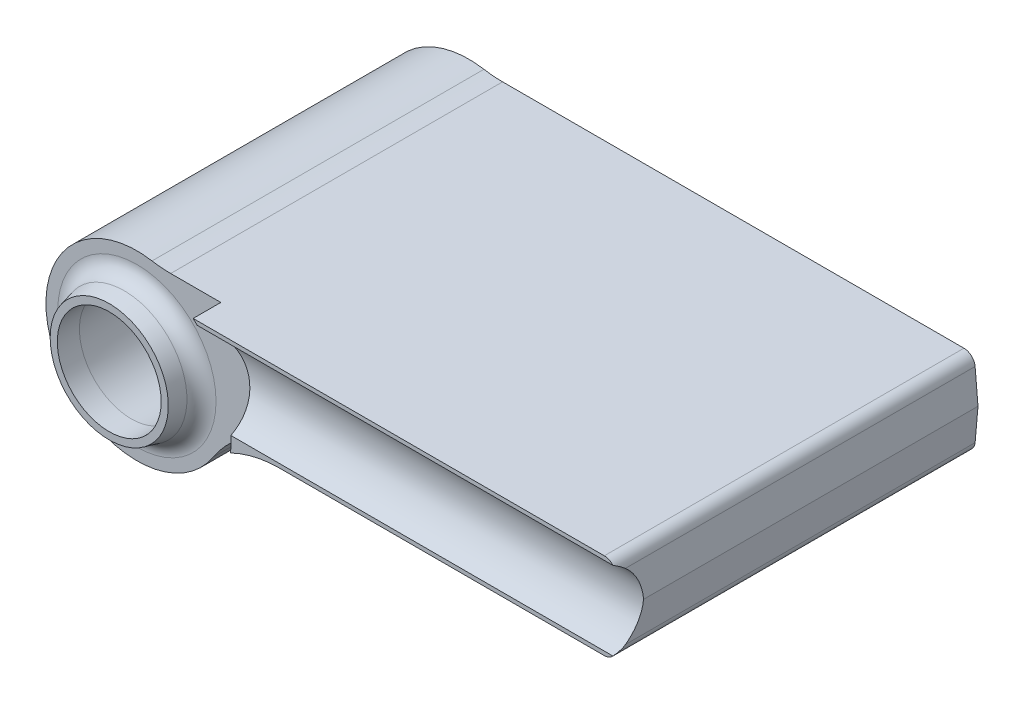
ISO-10303-21;
HEADER;
FILE_DESCRIPTION(('STEP AP214'),'2;1');
FILE_NAME('part.step','',(''),(''),'','','');
FILE_SCHEMA(('AUTOMOTIVE_DESIGN { 1 0 10303 214 1 1 1 1 }'));
ENDSEC;
DATA;
#1=APPLICATION_CONTEXT('core data for automotive mechanical design processes');
#2=APPLICATION_PROTOCOL_DEFINITION('international standard','automotive_design',2000,#1);
#3=PRODUCT_CONTEXT('',#1,'mechanical');
#4=PRODUCT('Part','Part','',(#3));
#5=PRODUCT_RELATED_PRODUCT_CATEGORY('part','',(#4));
#6=PRODUCT_DEFINITION_FORMATION('','',#4);
#7=PRODUCT_DEFINITION_CONTEXT('part definition',#1,'design');
#8=PRODUCT_DEFINITION('design','',#6,#7);
#9=PRODUCT_DEFINITION_SHAPE('','',#8);
#10=(LENGTH_UNIT() NAMED_UNIT(*) SI_UNIT(.MILLI.,.METRE.));
#11=(NAMED_UNIT(*) PLANE_ANGLE_UNIT() SI_UNIT($,.RADIAN.));
#12=(NAMED_UNIT(*) SI_UNIT($,.STERADIAN.) SOLID_ANGLE_UNIT());
#13=UNCERTAINTY_MEASURE_WITH_UNIT(LENGTH_MEASURE(1.E-05),#10,'distance_accuracy_value','');
#14=(GEOMETRIC_REPRESENTATION_CONTEXT(3) GLOBAL_UNCERTAINTY_ASSIGNED_CONTEXT((#13)) GLOBAL_UNIT_ASSIGNED_CONTEXT((#10,
#11,#12)) REPRESENTATION_CONTEXT('',''));
#15=CARTESIAN_POINT('',(0.,0.,0.));
#16=DIRECTION('',(0.,0.,1.));
#17=DIRECTION('',(1.,0.,0.));
#18=AXIS2_PLACEMENT_3D('',#15,#16,#17);
#19=CARTESIAN_POINT('',(30.8284770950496,-19.995,65.));
#20=DIRECTION('',(0.,0.,1.));
#21=DIRECTION('',(1.,0.,0.));
#22=AXIS2_PLACEMENT_3D('',#19,#20,#21);
#23=PLANE('',#22);
#24=DIRECTION('',(1.,0.,0.));
#25=VECTOR('',#24,1.);
#26=CARTESIAN_POINT('',(-16.446,1.0220196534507,65.));
#27=LINE('',#26,#25);
#28=CARTESIAN_POINT('',(91.0380668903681,1.0220196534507,65.));
#29=VERTEX_POINT('',#28);
#30=CARTESIAN_POINT('',(21.9762479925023,1.0220196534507,65.));
#31=VERTEX_POINT('',#30);
#32=EDGE_CURVE('E158',#29,#31,#27,.F.);
#33=ORIENTED_EDGE('',*,*,#32,.T.);
#34=CARTESIAN_POINT('',(0.,0.,65.));
#35=DIRECTION('',(0.,0.,-1.));
#36=DIRECTION('',(-1.,0.,0.));
#37=AXIS2_PLACEMENT_3D('',#34,#35,#36);
#38=CIRCLE('',#37,22.);
#39=CARTESIAN_POINT('',(21.9303605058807,-1.74908206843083,65.));
#40=VERTEX_POINT('',#39);
#41=EDGE_CURVE('E53',#31,#40,#38,.T.);
#42=ORIENTED_EDGE('',*,*,#41,.T.);
#43=CARTESIAN_POINT('',(30.8284770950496,-19.995,65.));
#44=DIRECTION('',(0.,0.,-1.));
#45=DIRECTION('',(1.,0.,0.));
#46=AXIS2_PLACEMENT_3D('',#43,#44,#45);
#47=CIRCLE('',#46,20.3);
#48=CARTESIAN_POINT('',(30.8284770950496,0.305,65.));
#49=VERTEX_POINT('',#48);
#50=EDGE_CURVE('E242',#40,#49,#47,.T.);
#51=ORIENTED_EDGE('',*,*,#50,.T.);
#52=DIRECTION('',(1.,0.,0.));
#53=VECTOR('',#52,1.);
#54=CARTESIAN_POINT('',(30.8284770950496,0.305,65.));
#55=LINE('',#54,#53);
#56=CARTESIAN_POINT('',(89.4898477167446,0.305,65.));
#57=VERTEX_POINT('',#56);
#58=EDGE_CURVE('E244',#49,#57,#55,.T.);
#59=ORIENTED_EDGE('',*,*,#58,.T.);
#60=CARTESIAN_POINT('',(89.4898477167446,2.335,65.));
#61=DIRECTION('',(0.,0.,1.));
#62=DIRECTION('',(1.,0.,0.));
#63=AXIS2_PLACEMENT_3D('',#60,#61,#62);
#64=CIRCLE('',#63,2.03);
#65=EDGE_CURVE('E246',#57,#29,#64,.T.);
#66=ORIENTED_EDGE('',*,*,#65,.T.);
#67=EDGE_LOOP('',(#33,#42,#51,#59,#66));
#68=FACE_BOUND('',#67,.T.);
#69=ADVANCED_FACE('F30',(#68),#23,.T.);
#70=CARTESIAN_POINT('',(30.8284770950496,-19.995,65.));
#71=DIRECTION('',(0.,0.,-1.));
#72=DIRECTION('',(-1.,0.,0.));
#73=AXIS2_PLACEMENT_3D('',#70,#71,#72);
#74=CYLINDRICAL_SURFACE('',#73,20.3);
#75=DIRECTION('',(0.,0.,-1.));
#76=VECTOR('',#75,1.);
#77=CARTESIAN_POINT('',(21.9303605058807,-1.74908206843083,62.5));
#78=LINE('',#77,#76);
#79=CARTESIAN_POINT('',(21.9303605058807,-1.74908206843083,60.));
#80=VERTEX_POINT('',#79);
#81=EDGE_CURVE('E209',#80,#40,#78,.F.);
#82=ORIENTED_EDGE('',*,*,#81,.F.);
#83=CARTESIAN_POINT('',(30.8284770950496,-19.995,60.));
#84=DIRECTION('',(0.,0.,1.));
#85=DIRECTION('',(1.,0.,0.));
#86=AXIS2_PLACEMENT_3D('',#83,#84,#85);
#87=CIRCLE('',#86,20.3);
#88=CARTESIAN_POINT('',(13.7970963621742,-8.94863995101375,60.));
#89=VERTEX_POINT('',#88);
#90=EDGE_CURVE('E215',#89,#80,#87,.F.);
#91=ORIENTED_EDGE('',*,*,#90,.F.);
#92=DIRECTION('',(0.,0.,-1.));
#93=VECTOR('',#92,1.);
#94=CARTESIAN_POINT('',(13.7970963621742,-8.94863995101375,65.));
#95=LINE('',#94,#93);
#96=CARTESIAN_POINT('',(13.7970963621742,-8.94863995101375,0.));
#97=VERTEX_POINT('',#96);
#98=EDGE_CURVE('E254',#89,#97,#95,.T.);
#99=ORIENTED_EDGE('',*,*,#98,.T.);
#100=CARTESIAN_POINT('',(30.8284770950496,-19.995,0.));
#101=DIRECTION('',(0.,0.,-1.));
#102=DIRECTION('',(1.,0.,0.));
#103=AXIS2_PLACEMENT_3D('',#100,#101,#102);
#104=CIRCLE('',#103,20.3);
#105=CARTESIAN_POINT('',(30.8284770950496,0.305,0.));
#106=VERTEX_POINT('',#105);
#107=EDGE_CURVE('E217',#97,#106,#104,.T.);
#108=ORIENTED_EDGE('',*,*,#107,.T.);
#109=DIRECTION('',(0.,0.,-1.));
#110=VECTOR('',#109,1.);
#111=CARTESIAN_POINT('',(30.8284770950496,0.305,65.));
#112=LINE('',#111,#110);
#113=EDGE_CURVE('E38',#49,#106,#112,.T.);
#114=ORIENTED_EDGE('',*,*,#113,.F.);
#115=ORIENTED_EDGE('',*,*,#50,.F.);
#116=EDGE_LOOP('',(#82,#91,#99,#108,#114,#115));
#117=FACE_BOUND('',#116,.T.);
#118=ADVANCED_FACE('F32',(#117),#74,.F.);
#119=CARTESIAN_POINT('',(6.10080322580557,15.935,65.));
#120=DIRECTION('',(0.,-1.,0.));
#121=DIRECTION('',(0.,0.,-1.));
#122=AXIS2_PLACEMENT_3D('',#119,#120,#121);
#123=PLANE('',#122);
#124=DIRECTION('',(0.,0.,-1.));
#125=VECTOR('',#124,1.);
#126=CARTESIAN_POINT('',(15.1682489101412,15.935,-7.82372390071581));
#127=LINE('',#126,#125);
#128=CARTESIAN_POINT('',(15.1682489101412,15.935,65.));
#129=VERTEX_POINT('',#128);
#130=CARTESIAN_POINT('',(15.1682489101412,15.935,60.));
#131=VERTEX_POINT('',#130);
#132=EDGE_CURVE('E207',#129,#131,#127,.T.);
#133=ORIENTED_EDGE('',*,*,#132,.F.);
#134=DIRECTION('',(-1.,0.,0.));
#135=VECTOR('',#134,1.);
#136=CARTESIAN_POINT('',(6.10080322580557,15.935,65.));
#137=LINE('',#136,#135);
#138=CARTESIAN_POINT('',(89.4898477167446,15.935,65.));
#139=VERTEX_POINT('',#138);
#140=EDGE_CURVE('E251',#139,#129,#137,.T.);
#141=ORIENTED_EDGE('',*,*,#140,.F.);
#142=DIRECTION('',(0.,0.,-1.));
#143=VECTOR('',#142,1.);
#144=CARTESIAN_POINT('',(89.4898477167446,15.935,65.));
#145=LINE('',#144,#143);
#146=CARTESIAN_POINT('',(89.4898477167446,15.935,0.));
#147=VERTEX_POINT('',#146);
#148=EDGE_CURVE('E260',#139,#147,#145,.T.);
#149=ORIENTED_EDGE('',*,*,#148,.T.);
#150=DIRECTION('',(-1.,0.,0.));
#151=VECTOR('',#150,1.);
#152=CARTESIAN_POINT('',(6.10080322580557,15.935,0.));
#153=LINE('',#152,#151);
#154=CARTESIAN_POINT('',(6.10080322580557,15.935,0.));
#155=VERTEX_POINT('',#154);
#156=EDGE_CURVE('E233',#147,#155,#153,.T.);
#157=ORIENTED_EDGE('',*,*,#156,.T.);
#158=DIRECTION('',(0.,0.,-1.));
#159=VECTOR('',#158,1.);
#160=CARTESIAN_POINT('',(6.10080322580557,15.935,65.));
#161=LINE('',#160,#159);
#162=CARTESIAN_POINT('',(6.10080322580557,15.935,60.));
#163=VERTEX_POINT('',#162);
#164=EDGE_CURVE('E258',#163,#155,#161,.T.);
#165=ORIENTED_EDGE('',*,*,#164,.F.);
#166=DIRECTION('',(-1.,0.,0.));
#167=VECTOR('',#166,1.);
#168=CARTESIAN_POINT('',(6.10080322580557,15.935,60.));
#169=LINE('',#168,#167);
#170=EDGE_CURVE('E213',#131,#163,#169,.T.);
#171=ORIENTED_EDGE('',*,*,#170,.F.);
#172=EDGE_LOOP('',(#133,#141,#149,#157,#165,#171));
#173=FACE_BOUND('',#172,.T.);
#174=ADVANCED_FACE('F305',(#173),#123,.F.);
#175=CARTESIAN_POINT('',(6.10080322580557,36.235,65.));
#176=DIRECTION('',(0.,0.,-1.));
#177=DIRECTION('',(-1.,0.,0.));
#178=AXIS2_PLACEMENT_3D('',#175,#176,#177);
#179=CYLINDRICAL_SURFACE('',#178,20.3);
#180=CARTESIAN_POINT('',(6.10080322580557,36.235,60.));
#181=DIRECTION('',(0.,0.,1.));
#182=DIRECTION('',(1.,0.,0.));
#183=AXIS2_PLACEMENT_3D('',#180,#181,#182);
#184=CIRCLE('',#183,20.3);
#185=CARTESIAN_POINT('',(2.73037716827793,16.216752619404,60.));
#186=VERTEX_POINT('',#185);
#187=EDGE_CURVE('E211',#163,#186,#184,.F.);
#188=ORIENTED_EDGE('',*,*,#187,.F.);
#189=ORIENTED_EDGE('',*,*,#164,.T.);
#190=CARTESIAN_POINT('',(6.10080322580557,36.235,0.));
#191=DIRECTION('',(0.,0.,-1.));
#192=DIRECTION('',(1.,0.,0.));
#193=AXIS2_PLACEMENT_3D('',#190,#191,#192);
#194=CIRCLE('',#193,20.3);
#195=CARTESIAN_POINT('',(2.73037716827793,16.216752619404,0.));
#196=VERTEX_POINT('',#195);
#197=EDGE_CURVE('E236',#155,#196,#194,.T.);
#198=ORIENTED_EDGE('',*,*,#197,.T.);
#199=DIRECTION('',(0.,0.,-1.));
#200=VECTOR('',#199,1.);
#201=CARTESIAN_POINT('',(2.73037716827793,16.216752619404,65.));
#202=LINE('',#201,#200);
#203=EDGE_CURVE('E256',#186,#196,#202,.T.);
#204=ORIENTED_EDGE('',*,*,#203,.F.);
#205=EDGE_LOOP('',(#188,#189,#198,#204));
#206=FACE_BOUND('',#205,.T.);
#207=ADVANCED_FACE('F309',(#206),#179,.F.);
#208=CARTESIAN_POINT('',(0.,0.,65.));
#209=DIRECTION('',(0.,0.,-1.));
#210=DIRECTION('',(-1.,0.,0.));
#211=AXIS2_PLACEMENT_3D('',#208,#209,#210);
#212=CYLINDRICAL_SURFACE('',#211,16.445);
#213=CARTESIAN_POINT('',(0.,0.,60.));
#214=DIRECTION('',(0.,0.,1.));
#215=DIRECTION('',(1.,0.,0.));
#216=AXIS2_PLACEMENT_3D('',#213,#214,#215);
#217=CIRCLE('',#216,16.445);
#218=EDGE_CURVE('E11',#186,#89,#217,.T.);
#219=ORIENTED_EDGE('',*,*,#218,.F.);
#220=ORIENTED_EDGE('',*,*,#203,.T.);
#221=CARTESIAN_POINT('',(0.,0.,0.));
#222=DIRECTION('',(0.,0.,1.));
#223=DIRECTION('',(1.,0.,0.));
#224=AXIS2_PLACEMENT_3D('',#221,#222,#223);
#225=CIRCLE('',#224,16.445);
#226=EDGE_CURVE('E239',#196,#97,#225,.T.);
#227=ORIENTED_EDGE('',*,*,#226,.T.);
#228=ORIENTED_EDGE('',*,*,#98,.F.);
#229=EDGE_LOOP('',(#219,#220,#227,#228));
#230=FACE_BOUND('',#229,.T.);
#231=ADVANCED_FACE('F313',(#230),#212,.T.);
#232=DIRECTION('',(1.,0.,0.));
#233=VECTOR('',#232,1.);
#234=CARTESIAN_POINT('',(-16.446,15.2179803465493,65.));
#235=LINE('',#234,#233);
#236=CARTESIAN_POINT('',(15.8875131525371,15.2179803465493,65.));
#237=VERTEX_POINT('',#236);
#238=CARTESIAN_POINT('',(91.0380668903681,15.2179803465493,65.));
#239=VERTEX_POINT('',#238);
#240=EDGE_CURVE('E45',#237,#239,#235,.T.);
#241=ORIENTED_EDGE('',*,*,#240,.T.);
#242=CARTESIAN_POINT('',(89.4898477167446,13.905,65.));
#243=DIRECTION('',(0.,0.,1.));
#244=DIRECTION('',(-1.,0.,0.));
#245=AXIS2_PLACEMENT_3D('',#242,#243,#244);
#246=CIRCLE('',#245,2.03);
#247=EDGE_CURVE('E249',#239,#139,#246,.T.);
#248=ORIENTED_EDGE('',*,*,#247,.T.);
#249=ORIENTED_EDGE('',*,*,#140,.T.);
#250=EDGE_CURVE('E204',#129,#237,#38,.T.);
#251=ORIENTED_EDGE('',*,*,#250,.T.);
#252=EDGE_LOOP('',(#241,#248,#249,#251));
#253=FACE_BOUND('',#252,.T.);
#254=ADVANCED_FACE('F315',(#253),#23,.T.);
#255=CARTESIAN_POINT('',(30.8284770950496,0.305,65.));
#256=DIRECTION('',(0.,1.,0.));
#257=DIRECTION('',(0.,0.,1.));
#258=AXIS2_PLACEMENT_3D('',#255,#256,#257);
#259=PLANE('',#258);
#260=DIRECTION('',(1.,0.,0.));
#261=VECTOR('',#260,1.);
#262=CARTESIAN_POINT('',(30.8284770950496,0.305,0.));
#263=LINE('',#262,#261);
#264=CARTESIAN_POINT('',(89.4898477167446,0.305,0.));
#265=VERTEX_POINT('',#264);
#266=EDGE_CURVE('E220',#106,#265,#263,.T.);
#267=ORIENTED_EDGE('',*,*,#266,.T.);
#268=DIRECTION('',(0.,0.,-1.));
#269=VECTOR('',#268,1.);
#270=CARTESIAN_POINT('',(89.4898477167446,0.305,65.));
#271=LINE('',#270,#269);
#272=EDGE_CURVE('E269',#57,#265,#271,.T.);
#273=ORIENTED_EDGE('',*,*,#272,.F.);
#274=ORIENTED_EDGE('',*,*,#58,.F.);
#275=ORIENTED_EDGE('',*,*,#113,.T.);
#276=EDGE_LOOP('',(#267,#273,#274,#275));
#277=FACE_BOUND('',#276,.T.);
#278=ADVANCED_FACE('F275',(#277),#259,.F.);
#279=CARTESIAN_POINT('',(89.4898477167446,2.335,65.));
#280=DIRECTION('',(0.,0.,-1.));
#281=DIRECTION('',(-1.,0.,0.));
#282=AXIS2_PLACEMENT_3D('',#279,#280,#281);
#283=CYLINDRICAL_SURFACE('',#282,2.03);
#284=DIRECTION('',(0.,0.,-1.));
#285=VECTOR('',#284,1.);
#286=CARTESIAN_POINT('',(91.5121229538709,2.15807384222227,65.));
#287=LINE('',#286,#285);
#288=CARTESIAN_POINT('',(91.5121229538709,2.15807384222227,63.2173114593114));
#289=VERTEX_POINT('',#288);
#290=CARTESIAN_POINT('',(91.5121229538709,2.15807384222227,0.));
#291=VERTEX_POINT('',#290);
#292=EDGE_CURVE('E267',#289,#291,#287,.T.);
#293=ORIENTED_EDGE('',*,*,#292,.F.);
#294=CARTESIAN_POINT('',(89.4898477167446,0.304999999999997,68.27));
#295=CARTESIAN_POINT('',(89.4899637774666,0.305000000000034,68.2699996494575));
#296=CARTESIAN_POINT('',(89.4900798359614,0.305000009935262,68.2696233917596));
#297=CARTESIAN_POINT('',(89.4904042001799,0.305000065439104,68.2687686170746));
#298=CARTESIAN_POINT('',(89.4906125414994,0.305000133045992,68.2684463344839));
#299=CARTESIAN_POINT('',(89.4914064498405,0.305000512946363,68.2670984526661));
#300=CARTESIAN_POINT('',(89.4919911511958,0.305001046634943,68.2658570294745));
#301=CARTESIAN_POINT('',(89.4943414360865,0.305004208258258,68.2609940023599));
#302=CARTESIAN_POINT('',(89.4961088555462,0.305008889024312,68.2576248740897));
#303=CARTESIAN_POINT('',(89.53065508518,0.305145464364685,68.1916066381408));
#304=CARTESIAN_POINT('',(89.5634122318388,0.306068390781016,68.1261074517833));
#305=CARTESIAN_POINT('',(89.6293188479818,0.309524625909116,67.9957871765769));
#306=CARTESIAN_POINT('',(89.6624677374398,0.312079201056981,67.9309867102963));
#307=CARTESIAN_POINT('',(89.727388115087,0.318691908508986,67.8034780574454));
#308=CARTESIAN_POINT('',(89.7591637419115,0.322688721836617,67.7407847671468));
#309=CARTESIAN_POINT('',(89.8224569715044,0.332179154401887,67.6157641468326));
#310=CARTESIAN_POINT('',(89.8539750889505,0.33766744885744,67.5534363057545));
#311=CARTESIAN_POINT('',(89.9551047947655,0.357757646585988,67.3528955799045));
#312=CARTESIAN_POINT('',(90.0243439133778,0.37531654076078,67.2147439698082));
#313=CARTESIAN_POINT('',(90.1619635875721,0.418127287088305,66.9376203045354));
#314=CARTESIAN_POINT('',(90.2303304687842,0.443448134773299,66.7986523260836));
#315=CARTESIAN_POINT('',(90.3493934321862,0.495091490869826,66.5533568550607));
#316=CARTESIAN_POINT('',(90.4005228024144,0.519830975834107,66.4469061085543));
#317=CARTESIAN_POINT('',(90.501118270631,0.573896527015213,66.2346836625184));
#318=CARTESIAN_POINT('',(90.5505877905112,0.603212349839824,66.128910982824));
#319=CARTESIAN_POINT('',(90.646702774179,0.665924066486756,65.9199702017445));
#320=CARTESIAN_POINT('',(90.6933845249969,0.699229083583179,65.81679158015));
#321=CARTESIAN_POINT('',(90.7846165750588,0.770447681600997,65.6110218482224));
#322=CARTESIAN_POINT('',(90.8291658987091,0.808363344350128,65.5084310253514));
#323=CARTESIAN_POINT('',(90.9261128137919,0.898540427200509,65.279464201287));
#324=CARTESIAN_POINT('',(90.9778272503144,0.952060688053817,65.1532903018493));
#325=CARTESIAN_POINT('',(91.0766900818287,1.06669990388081,64.9018619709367));
#326=CARTESIAN_POINT('',(91.123817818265,1.12785064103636,64.7766138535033));
#327=CARTESIAN_POINT('',(91.2140931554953,1.26048335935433,64.5226482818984));
#328=CARTESIAN_POINT('',(91.2569850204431,1.33229489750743,64.3940109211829));
#329=CARTESIAN_POINT('',(91.334900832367,1.48414625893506,64.139431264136));
#330=CARTESIAN_POINT('',(91.3699352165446,1.56417495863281,64.0134855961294));
#331=CARTESIAN_POINT('',(91.4229837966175,1.7117617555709,63.7954590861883));
#332=CARTESIAN_POINT('',(91.4430647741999,1.77753932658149,63.7026747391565));
#333=CARTESIAN_POINT('',(91.4768896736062,1.91370692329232,63.5192954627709));
#334=CARTESIAN_POINT('',(91.4906318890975,1.98409818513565,63.4287011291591));
#335=CARTESIAN_POINT('',(91.5106152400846,2.12847684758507,63.2511535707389));
#336=CARTESIAN_POINT('',(91.5169349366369,2.20241780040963,63.164171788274));
#337=CARTESIAN_POINT('',(91.5211755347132,2.35414771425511,62.9934268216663));
#338=CARTESIAN_POINT('',(91.5190976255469,2.43193612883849,62.9096631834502));
#339=CARTESIAN_POINT('',(91.5025134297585,2.62213675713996,62.7136558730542));
#340=CARTESIAN_POINT('',(91.4834244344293,2.73609413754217,62.6032237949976));
#341=CARTESIAN_POINT('',(91.4225359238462,2.96736786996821,62.3921555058));
#342=CARTESIAN_POINT('',(91.3807286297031,3.08468535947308,62.2915226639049));
#343=CARTESIAN_POINT('',(91.2816063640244,3.29481520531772,62.1213065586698));
#344=CARTESIAN_POINT('',(91.2288794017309,3.38796217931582,62.049488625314));
#345=CARTESIAN_POINT('',(91.1052722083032,3.56922469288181,61.9156841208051));
#346=CARTESIAN_POINT('',(91.034403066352,3.65734326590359,61.8536915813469));
#347=CARTESIAN_POINT('',(90.8738420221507,3.82463070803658,61.7405028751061));
#348=CARTESIAN_POINT('',(90.7840006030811,3.90372030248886,61.6893993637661));
#349=CARTESIAN_POINT('',(90.5875653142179,4.04691311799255,61.5998156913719));
#350=CARTESIAN_POINT('',(90.4809829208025,4.11102653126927,61.5613269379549));
#351=CARTESIAN_POINT('',(90.2704232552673,4.21204578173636,61.5020553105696));
#352=CARTESIAN_POINT('',(90.1681427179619,4.25149458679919,61.4795550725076));
#353=CARTESIAN_POINT('',(89.9569823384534,4.31357807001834,61.4445575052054));
#354=CARTESIAN_POINT('',(89.8481060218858,4.33622164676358,61.4320548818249));
#355=CARTESIAN_POINT('',(89.6365276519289,4.36226663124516,61.4177112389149));
#356=CARTESIAN_POINT('',(89.5340514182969,4.36709367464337,61.4150800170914));
#357=CARTESIAN_POINT('',(89.3296884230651,4.36125011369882,61.4182821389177));
#358=CARTESIAN_POINT('',(89.227801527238,4.35058319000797,61.4241134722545));
#359=CARTESIAN_POINT('',(89.0295772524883,4.31464677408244,61.444026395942));
#360=CARTESIAN_POINT('',(88.9331701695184,4.28966831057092,61.4579436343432));
#361=CARTESIAN_POINT('',(88.7463811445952,4.22652789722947,61.4938351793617));
#362=CARTESIAN_POINT('',(88.6559992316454,4.18836588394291,61.5158095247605));
#363=CARTESIAN_POINT('',(88.4815317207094,4.09964940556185,61.5682312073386));
#364=CARTESIAN_POINT('',(88.3976297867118,4.04883931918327,61.5988553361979));
#365=CARTESIAN_POINT('',(88.2401191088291,3.93761758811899,61.6680166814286));
#366=CARTESIAN_POINT('',(88.1665124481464,3.87720400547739,61.7065554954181));
#367=CARTESIAN_POINT('',(88.0257768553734,3.74474634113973,61.7940370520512));
#368=CARTESIAN_POINT('',(87.9594800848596,3.67218082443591,61.8435245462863));
#369=CARTESIAN_POINT('',(87.8402240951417,3.52195380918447,61.95013402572));
#370=CARTESIAN_POINT('',(87.7872703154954,3.44429024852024,62.007259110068));
#371=CARTESIAN_POINT('',(87.6754922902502,3.25453973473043,62.1527354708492));
#372=CARTESIAN_POINT('',(87.6229702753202,3.14124547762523,62.2443658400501));
#373=CARTESIAN_POINT('',(87.5408391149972,2.91533810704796,62.4383608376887));
#374=CARTESIAN_POINT('',(87.5112909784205,2.80272758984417,62.5407532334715));
#375=CARTESIAN_POINT('',(87.4778321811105,2.61566677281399,62.7213089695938));
#376=CARTESIAN_POINT('',(87.4688594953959,2.54001864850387,62.7973804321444));
#377=CARTESIAN_POINT('',(87.459277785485,2.3916615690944,62.9528649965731));
#378=CARTESIAN_POINT('',(87.4586720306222,2.31895377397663,63.032279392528));
#379=CARTESIAN_POINT('',(87.4677768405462,2.10650497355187,63.2742064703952));
#380=CARTESIAN_POINT('',(87.4883313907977,1.97191074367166,63.4409125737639));
#381=CARTESIAN_POINT('',(87.54335668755,1.75051151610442,63.7390726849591));
#382=CARTESIAN_POINT('',(87.5730596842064,1.66017461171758,63.8689125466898));
#383=CARTESIAN_POINT('',(87.6424125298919,1.48856816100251,64.1320076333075));
#384=CARTESIAN_POINT('',(87.6820684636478,1.40730420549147,64.2652649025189));
#385=CARTESIAN_POINT('',(87.7703850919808,1.25218121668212,64.5373882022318));
#386=CARTESIAN_POINT('',(87.8192294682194,1.17853170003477,64.6763129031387));
#387=CARTESIAN_POINT('',(87.9236234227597,1.04066223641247,64.9561624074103));
#388=CARTESIAN_POINT('',(87.9791693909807,0.976437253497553,65.0970860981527));
#389=CARTESIAN_POINT('',(88.1270000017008,0.825031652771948,65.456882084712));
#390=CARTESIAN_POINT('',(88.2229680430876,0.744099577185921,65.6768866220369));
#391=CARTESIAN_POINT('',(88.4240445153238,0.602921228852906,66.1201110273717));
#392=CARTESIAN_POINT('',(88.5291798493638,0.542738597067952,66.3433386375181));
#393=CARTESIAN_POINT('',(88.7352146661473,0.447388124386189,66.7704791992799));
#394=CARTESIAN_POINT('',(88.83559120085,0.41040763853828,66.974246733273));
#395=CARTESIAN_POINT('',(89.0382771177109,0.35309167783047,67.3806144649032));
#396=CARTESIAN_POINT('',(89.1405567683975,0.332591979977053,67.5832056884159));
#397=CARTESIAN_POINT('',(89.2603919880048,0.317937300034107,67.8192570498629));
#398=CARTESIAN_POINT('',(89.2773721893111,0.31607811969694,67.8526741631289));
#399=CARTESIAN_POINT('',(89.3117803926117,0.312749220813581,67.9203914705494));
#400=CARTESIAN_POINT('',(89.3292090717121,0.311290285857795,67.9546930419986));
#401=CARTESIAN_POINT('',(89.3701322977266,0.308396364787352,68.034967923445));
#402=CARTESIAN_POINT('',(89.3936357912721,0.307144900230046,68.0808664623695));
#403=CARTESIAN_POINT('',(89.4386951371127,0.305529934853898,68.1699304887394));
#404=CARTESIAN_POINT('',(89.4602501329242,0.30510114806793,68.2130051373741));
#405=CARTESIAN_POINT('',(89.4835802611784,0.305008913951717,68.257614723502));
#406=CARTESIAN_POINT('',(89.4853413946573,0.305004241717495,68.2609697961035));
#407=CARTESIAN_POINT('',(89.4876900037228,0.305001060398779,68.2658295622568));
#408=CARTESIAN_POINT('',(89.4882793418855,0.305000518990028,68.2670815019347));
#409=CARTESIAN_POINT('',(89.4890792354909,0.305000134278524,68.2684386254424));
#410=CARTESIAN_POINT('',(89.4892889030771,0.305000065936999,68.2687625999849));
#411=CARTESIAN_POINT('',(89.4896149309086,0.305000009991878,68.2696226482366));
#412=CARTESIAN_POINT('',(89.4897313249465,0.30499999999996,68.2700003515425));
#413=CARTESIAN_POINT('',(89.4898477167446,0.304999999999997,68.27));
#414=B_SPLINE_CURVE_WITH_KNOTS('',3,(#294,#295,#296,#297,#298,#299,#300,#301,#302,#303,#304,
#305,#306,#307,#308,#309,#310,#311,#312,#313,#314,#315,#316,#317,#318,#319,#320,#321,#322,#323,
#324,#325,#326,#327,#328,#329,#330,#331,#332,#333,#334,#335,#336,#337,#338,#339,#340,#341,#342,
#343,#344,#345,#346,#347,#348,#349,#350,#351,#352,#353,#354,#355,#356,#357,#358,#359,#360,#361,
#362,#363,#364,#365,#366,#367,#368,#369,#370,#371,#372,#373,#374,#375,#376,#377,#378,#379,#380,
#381,#382,#383,#384,#385,#386,#387,#388,#389,#390,#391,#392,#393,#394,#395,#396,#397,#398,#399,
#400,#401,#402,#403,#404,#405,#406,#407,#408,#409,#410,#411,#412,#413),.UNSPECIFIED.,.T.,.F.,(4,
2,2,2,2,2,2,2,2,2,2,2,2,2,2,2,2,2,2,2,2,2,2,2,2,2,2,2,2,2,2,2,2,2,2,2,2,2,2,2,2,2,2,2,2,2,2,2,2,
2,2,2,2,2,2,2,2,2,2,4),(0.,0.000766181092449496,0.00214105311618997,0.00600843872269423,
0.0176805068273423,0.234160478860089,0.453521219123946,0.664482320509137,0.874699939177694,
1.34103016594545,1.81163206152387,2.17350661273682,2.53458248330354,2.88860576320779,
3.2427894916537,3.68199558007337,4.1230962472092,4.58302400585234,5.04233716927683,
5.38856924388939,5.73489446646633,6.07752011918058,6.42009724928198,6.89791947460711,
7.3759054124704,7.76107080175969,8.14600132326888,8.53408686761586,8.92190752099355,
9.25582729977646,9.58957013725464,9.89594534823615,10.2022477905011,10.5025320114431,
10.8028176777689,11.10975050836,11.4167453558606,11.7455584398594,12.0745053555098,
12.5366226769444,12.9999630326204,13.3225111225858,13.6451852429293,14.288346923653,
14.7706107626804,15.2531701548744,15.7466640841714,16.2398933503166,16.9985775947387,
17.7595685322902,18.4494127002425,19.1322946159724,19.2449063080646,19.360306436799,
19.5156994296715,19.6581476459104,19.6697780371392,19.6736761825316,19.6750597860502,
19.6758281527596),.UNSPECIFIED.);
#415=EDGE_CURVE('E159',#29,#289,#414,.T.);
#416=ORIENTED_EDGE('',*,*,#415,.F.);
#417=ORIENTED_EDGE('',*,*,#65,.F.);
#418=ORIENTED_EDGE('',*,*,#272,.T.);
#419=CARTESIAN_POINT('',(89.4898477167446,2.335,0.));
#420=DIRECTION('',(0.,0.,1.));
#421=DIRECTION('',(1.,0.,0.));
#422=AXIS2_PLACEMENT_3D('',#419,#420,#421);
#423=CIRCLE('',#422,2.03);
#424=EDGE_CURVE('E222',#265,#291,#423,.T.);
#425=ORIENTED_EDGE('',*,*,#424,.T.);
#426=EDGE_LOOP('',(#293,#416,#417,#418,#425));
#427=FACE_BOUND('',#426,.T.);
#428=ADVANCED_FACE('F292',(#427),#283,.T.);
#429=CARTESIAN_POINT('',(91.5121229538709,2.15807384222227,65.));
#430=DIRECTION('',(-0.996194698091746,0.0871557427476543,0.));
#431=DIRECTION('',(-0.0871557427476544,-0.996194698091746,0.));
#432=AXIS2_PLACEMENT_3D('',#429,#430,#431);
#433=PLANE('',#432);
#434=DIRECTION('',(0.,0.,-1.));
#435=VECTOR('',#434,1.);
#436=CARTESIAN_POINT('',(92.0337239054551,8.12,65.));
#437=LINE('',#436,#435);
#438=CARTESIAN_POINT('',(92.0337239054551,8.12,60.455));
#439=VERTEX_POINT('',#438);
#440=CARTESIAN_POINT('',(92.0337239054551,8.12,0.));
#441=VERTEX_POINT('',#440);
#442=EDGE_CURVE('E265',#439,#441,#437,.T.);
#443=ORIENTED_EDGE('',*,*,#442,.F.);
#444=CARTESIAN_POINT('',(92.0337239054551,8.12,68.27));
#445=DIRECTION('',(-0.996194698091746,0.0871557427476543,0.));
#446=DIRECTION('',(0.0871557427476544,0.996194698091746,0.));
#447=AXIS2_PLACEMENT_3D('',#444,#445,#446);
#448=ELLIPSE('',#447,7.84485203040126,7.815);
#449=EDGE_CURVE('E166',#289,#439,#448,.F.);
#450=ORIENTED_EDGE('',*,*,#449,.F.);
#451=ORIENTED_EDGE('',*,*,#292,.T.);
#452=DIRECTION('',(0.0871557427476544,0.996194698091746,0.));
#453=VECTOR('',#452,1.);
#454=CARTESIAN_POINT('',(91.5121229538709,2.15807384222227,0.));
#455=LINE('',#454,#453);
#456=EDGE_CURVE('E225',#291,#441,#455,.T.);
#457=ORIENTED_EDGE('',*,*,#456,.T.);
#458=EDGE_LOOP('',(#443,#450,#451,#457));
#459=FACE_BOUND('',#458,.T.);
#460=ADVANCED_FACE('F507',(#459),#433,.F.);
#461=CARTESIAN_POINT('',(91.5121229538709,14.0819261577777,65.));
#462=DIRECTION('',(-0.996194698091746,-0.0871557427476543,0.));
#463=DIRECTION('',(0.0871557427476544,-0.996194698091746,0.));
#464=AXIS2_PLACEMENT_3D('',#461,#462,#463);
#465=PLANE('',#464);
#466=DIRECTION('',(0.,0.,-1.));
#467=VECTOR('',#466,1.);
#468=CARTESIAN_POINT('',(91.5121229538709,14.0819261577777,65.));
#469=LINE('',#468,#467);
#470=CARTESIAN_POINT('',(91.5121229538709,14.0819261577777,63.2173114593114));
#471=VERTEX_POINT('',#470);
#472=CARTESIAN_POINT('',(91.5121229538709,14.0819261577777,0.));
#473=VERTEX_POINT('',#472);
#474=EDGE_CURVE('E263',#471,#473,#469,.T.);
#475=ORIENTED_EDGE('',*,*,#474,.F.);
#476=CARTESIAN_POINT('',(92.0337239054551,8.12,68.27));
#477=DIRECTION('',(-0.996194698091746,-0.0871557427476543,0.));
#478=DIRECTION('',(0.0871557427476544,-0.996194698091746,0.));
#479=AXIS2_PLACEMENT_3D('',#476,#477,#478);
#480=ELLIPSE('',#479,7.84485203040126,7.815);
#481=EDGE_CURVE('E186',#439,#471,#480,.F.);
#482=ORIENTED_EDGE('',*,*,#481,.F.);
#483=ORIENTED_EDGE('',*,*,#442,.T.);
#484=DIRECTION('',(-0.0871557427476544,0.996194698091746,0.));
#485=VECTOR('',#484,1.);
#486=CARTESIAN_POINT('',(91.5121229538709,14.0819261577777,0.));
#487=LINE('',#486,#485);
#488=EDGE_CURVE('E228',#441,#473,#487,.T.);
#489=ORIENTED_EDGE('',*,*,#488,.T.);
#490=EDGE_LOOP('',(#475,#482,#483,#489));
#491=FACE_BOUND('',#490,.T.);
#492=ADVANCED_FACE('F362',(#491),#465,.F.);
#493=CARTESIAN_POINT('',(89.4898477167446,13.905,65.));
#494=DIRECTION('',(0.,0.,-1.));
#495=DIRECTION('',(-1.,0.,0.));
#496=AXIS2_PLACEMENT_3D('',#493,#494,#495);
#497=CYLINDRICAL_SURFACE('',#496,2.03);
#498=ORIENTED_EDGE('',*,*,#247,.F.);
#499=CARTESIAN_POINT('',(89.4898477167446,15.935,68.27));
#500=CARTESIAN_POINT('',(89.4897316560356,15.935,68.2699996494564));
#501=CARTESIAN_POINT('',(89.4896155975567,15.9349999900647,68.2696233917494));
#502=CARTESIAN_POINT('',(89.4892912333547,15.9349999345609,68.2687686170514));
#503=CARTESIAN_POINT('',(89.4890828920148,15.934999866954,68.2684463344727));
#504=CARTESIAN_POINT('',(89.4882889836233,15.9349994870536,68.2670984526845));
#505=CARTESIAN_POINT('',(89.487704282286,15.9349989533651,68.2658570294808));
#506=CARTESIAN_POINT('',(89.4853539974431,15.9349957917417,68.2609940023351));
#507=CARTESIAN_POINT('',(89.4835865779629,15.9349911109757,68.2576248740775));
#508=CARTESIAN_POINT('',(89.4490403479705,15.9348545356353,68.1916066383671));
#509=CARTESIAN_POINT('',(89.4162832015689,15.9339316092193,68.1261074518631));
#510=CARTESIAN_POINT('',(89.3503765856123,15.9304753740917,67.995787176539));
#511=CARTESIAN_POINT('',(89.3172276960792,15.9279207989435,67.9309867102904));
#512=CARTESIAN_POINT('',(89.2523073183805,15.9213080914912,67.8034780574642));
#513=CARTESIAN_POINT('',(89.2205316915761,15.917311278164,67.7407847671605));
#514=CARTESIAN_POINT('',(89.1572384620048,15.9078208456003,67.6157641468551));
#515=CARTESIAN_POINT('',(89.1257203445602,15.902332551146,67.5534363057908));
#516=CARTESIAN_POINT('',(89.024590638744,15.88224235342,67.3528955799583));
#517=CARTESIAN_POINT('',(88.9553515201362,15.8646834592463,67.2147439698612));
#518=CARTESIAN_POINT('',(88.8177318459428,15.8218727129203,66.9376203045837));
#519=CARTESIAN_POINT('',(88.7493649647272,15.7965518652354,66.7986523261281));
#520=CARTESIAN_POINT('',(88.6303020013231,15.7449085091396,66.553356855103));
#521=CARTESIAN_POINT('',(88.5791726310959,15.7201690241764,66.4469061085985));
#522=CARTESIAN_POINT('',(88.4785771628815,15.666103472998,66.2346836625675));
#523=CARTESIAN_POINT('',(88.4291076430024,15.636787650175,66.1289109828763));
#524=CARTESIAN_POINT('',(88.3329926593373,15.574075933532,65.9199702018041));
#525=CARTESIAN_POINT('',(88.286310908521,15.5407709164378,65.8167915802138));
#526=CARTESIAN_POINT('',(88.1950788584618,15.4695523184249,65.6110218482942));
#527=CARTESIAN_POINT('',(88.1505295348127,15.4316366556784,65.508431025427));
#528=CARTESIAN_POINT('',(88.0535826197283,15.3414595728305,65.2794642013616));
#529=CARTESIAN_POINT('',(88.001868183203,15.2879393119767,65.1532903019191));
#530=CARTESIAN_POINT('',(87.9030053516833,15.1733000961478,64.9018619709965));
#531=CARTESIAN_POINT('',(87.8558776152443,15.112149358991,64.7766138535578));
#532=CARTESIAN_POINT('',(87.7656022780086,14.9795166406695,64.5226482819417));
#533=CARTESIAN_POINT('',(87.7227104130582,14.9077051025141,64.3940109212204));
#534=CARTESIAN_POINT('',(87.6447946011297,14.7558537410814,64.1394312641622));
#535=CARTESIAN_POINT('',(87.60976021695,14.6758250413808,64.0134855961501));
#536=CARTESIAN_POINT('',(87.5567116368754,14.5282382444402,63.7954590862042));
#537=CARTESIAN_POINT('',(87.5366306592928,14.4624606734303,63.7026747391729));
#538=CARTESIAN_POINT('',(87.5028057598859,14.326293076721,63.5192954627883));
#539=CARTESIAN_POINT('',(87.4890635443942,14.2559018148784,63.4287011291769));
#540=CARTESIAN_POINT('',(87.4690801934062,14.1115231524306,63.2511535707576));
#541=CARTESIAN_POINT('',(87.4627604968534,14.0375821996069,63.1641717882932));
#542=CARTESIAN_POINT('',(87.4585198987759,13.8858522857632,62.9934268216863));
#543=CARTESIAN_POINT('',(87.4605978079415,13.8080638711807,62.9096631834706));
#544=CARTESIAN_POINT('',(87.477182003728,13.6178632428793,62.7136558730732));
#545=CARTESIAN_POINT('',(87.4962709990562,13.5039058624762,62.603223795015));
#546=CARTESIAN_POINT('',(87.5571595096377,13.2726321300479,62.3921555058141));
#547=CARTESIAN_POINT('',(87.5989668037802,13.1553146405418,62.2915226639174));
#548=CARTESIAN_POINT('',(87.6980890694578,12.9451847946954,62.1213065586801));
#549=CARTESIAN_POINT('',(87.7508160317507,12.8520378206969,62.0494886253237));
#550=CARTESIAN_POINT('',(87.8744232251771,12.6707753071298,61.9156841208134));
#551=CARTESIAN_POINT('',(87.9452923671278,12.5826567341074,61.8536915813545));
#552=CARTESIAN_POINT('',(88.1058534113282,12.415369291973,61.7405028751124));
#553=CARTESIAN_POINT('',(88.1956948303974,12.33627969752,61.6893993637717));
#554=CARTESIAN_POINT('',(88.3921301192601,12.1930868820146,61.5998156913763));
#555=CARTESIAN_POINT('',(88.4987125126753,12.1289734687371,61.5613269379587));
#556=CARTESIAN_POINT('',(88.7092721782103,12.0279542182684,61.5020553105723));
#557=CARTESIAN_POINT('',(88.8115527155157,11.9885054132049,61.4795550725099));
#558=CARTESIAN_POINT('',(89.0227130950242,11.9264219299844,61.4445575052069));
#559=CARTESIAN_POINT('',(89.1315894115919,11.9037783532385,61.432054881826));
#560=CARTESIAN_POINT('',(89.343167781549,11.8777333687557,61.4177112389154));
#561=CARTESIAN_POINT('',(89.4456440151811,11.8729063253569,61.4150800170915));
#562=CARTESIAN_POINT('',(89.6500070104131,11.8787498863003,61.4182821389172));
#563=CARTESIAN_POINT('',(89.7518939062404,11.8894168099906,61.4241134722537));
#564=CARTESIAN_POINT('',(89.9501181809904,11.9253532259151,61.4440263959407));
#565=CARTESIAN_POINT('',(90.0465252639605,11.9503316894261,61.4579436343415));
#566=CARTESIAN_POINT('',(90.2333142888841,12.0134721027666,61.4938351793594));
#567=CARTESIAN_POINT('',(90.3236962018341,12.0516341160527,61.5158095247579));
#568=CARTESIAN_POINT('',(90.4981637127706,12.1403505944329,61.5682312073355));
#569=CARTESIAN_POINT('',(90.5820656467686,12.1911606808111,61.5988553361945));
#570=CARTESIAN_POINT('',(90.7395763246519,12.3023824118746,61.6680166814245));
#571=CARTESIAN_POINT('',(90.8131829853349,12.3627959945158,61.7065554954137));
#572=CARTESIAN_POINT('',(90.9539185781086,12.4952536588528,61.7940370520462));
#573=CARTESIAN_POINT('',(91.0202153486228,12.5678191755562,61.8435245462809));
#574=CARTESIAN_POINT('',(91.1394713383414,12.718046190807,61.9501340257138));
#575=CARTESIAN_POINT('',(91.1924251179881,12.795709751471,62.0072591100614));
#576=CARTESIAN_POINT('',(91.3042031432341,12.9854602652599,62.1527354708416));
#577=CARTESIAN_POINT('',(91.3567251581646,13.0987545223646,62.2443658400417));
#578=CARTESIAN_POINT('',(91.4388563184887,13.3246618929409,62.4383608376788));
#579=CARTESIAN_POINT('',(91.468404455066,13.4372724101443,62.5407532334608));
#580=CARTESIAN_POINT('',(91.501863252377,13.6243332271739,62.7213089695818));
#581=CARTESIAN_POINT('',(91.5108359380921,13.6999813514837,62.7973804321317));
#582=CARTESIAN_POINT('',(91.5204176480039,13.8483384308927,62.9528649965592));
#583=CARTESIAN_POINT('',(91.5210234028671,13.9210462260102,63.0322793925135));
#584=CARTESIAN_POINT('',(91.5119185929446,14.1334950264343,63.2742064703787));
#585=CARTESIAN_POINT('',(91.4913640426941,14.2680892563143,63.4409125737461));
#586=CARTESIAN_POINT('',(91.4363387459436,14.4894884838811,63.7390726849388));
#587=CARTESIAN_POINT('',(91.406635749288,14.5798253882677,63.8689125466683));
#588=CARTESIAN_POINT('',(91.3372829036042,14.7514318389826,64.1320076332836));
#589=CARTESIAN_POINT('',(91.2976269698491,14.8326957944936,64.2652649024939));
#590=CARTESIAN_POINT('',(91.2093103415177,14.9878187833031,64.5373882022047));
#591=CARTESIAN_POINT('',(91.1604659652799,15.0614682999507,64.6763129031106));
#592=CARTESIAN_POINT('',(91.0560720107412,15.1993377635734,64.9561624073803));
#593=CARTESIAN_POINT('',(91.000526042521,15.2635627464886,65.0970860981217));
#594=CARTESIAN_POINT('',(90.8526954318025,15.4149683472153,65.4568820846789));
#595=CARTESIAN_POINT('',(90.7567273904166,15.4959004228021,65.6768866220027));
#596=CARTESIAN_POINT('',(90.5556509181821,15.6370787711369,66.1201110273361));
#597=CARTESIAN_POINT('',(90.450515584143,15.6972614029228,66.3433386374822));
#598=CARTESIAN_POINT('',(90.24448076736,15.7926118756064,66.770479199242));
#599=CARTESIAN_POINT('',(90.1441042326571,15.8295923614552,66.9742467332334));
#600=CARTESIAN_POINT('',(89.9414183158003,15.8869083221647,67.3806144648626));
#601=CARTESIAN_POINT('',(89.8391386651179,15.9074080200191,67.5832056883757));
#602=CARTESIAN_POINT('',(89.7193034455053,15.9220626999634,67.8192570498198));
#603=CARTESIAN_POINT('',(89.7023232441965,15.923921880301,67.8526741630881));
#604=CARTESIAN_POINT('',(89.6679150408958,15.927250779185,67.9203914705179));
#605=CARTESIAN_POINT('',(89.6504863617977,15.928709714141,67.9546930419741));
#606=CARTESIAN_POINT('',(89.6095631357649,15.9316036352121,68.0349679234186));
#607=CARTESIAN_POINT('',(89.5860596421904,15.9328550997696,68.0808664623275));
#608=CARTESIAN_POINT('',(89.5410002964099,15.9344700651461,68.1699304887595));
#609=CARTESIAN_POINT('',(89.5194453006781,15.9348988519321,68.213005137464));
#610=CARTESIAN_POINT('',(89.4961151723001,15.9349910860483,68.2576147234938));
#611=CARTESIAN_POINT('',(89.4943540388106,15.9349957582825,68.2609697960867));
#612=CARTESIAN_POINT('',(89.4920054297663,15.9349989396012,68.2658295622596));
#613=CARTESIAN_POINT('',(89.4914160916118,15.93499948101,68.2670815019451));
#614=CARTESIAN_POINT('',(89.4906161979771,15.9349998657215,68.2684386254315));
#615=CARTESIAN_POINT('',(89.4904065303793,15.934999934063,68.2687625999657));
#616=CARTESIAN_POINT('',(89.4900805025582,15.9349999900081,68.2696226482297));
#617=CARTESIAN_POINT('',(89.48996410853,15.935,68.2700003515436));
#618=CARTESIAN_POINT('',(89.4898477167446,15.935,68.27));
#619=B_SPLINE_CURVE_WITH_KNOTS('',3,(#499,#500,#501,#502,#503,#504,#505,#506,#507,#508,#509,
#510,#511,#512,#513,#514,#515,#516,#517,#518,#519,#520,#521,#522,#523,#524,#525,#526,#527,#528,
#529,#530,#531,#532,#533,#534,#535,#536,#537,#538,#539,#540,#541,#542,#543,#544,#545,#546,#547,
#548,#549,#550,#551,#552,#553,#554,#555,#556,#557,#558,#559,#560,#561,#562,#563,#564,#565,#566,
#567,#568,#569,#570,#571,#572,#573,#574,#575,#576,#577,#578,#579,#580,#581,#582,#583,#584,#585,
#586,#587,#588,#589,#590,#591,#592,#593,#594,#595,#596,#597,#598,#599,#600,#601,#602,#603,#604,
#605,#606,#607,#608,#609,#610,#611,#612,#613,#614,#615,#616,#617,#618),.UNSPECIFIED.,.T.,.F.,(4,
2,2,2,2,2,2,2,2,2,2,2,2,2,2,2,2,2,2,2,2,2,2,2,2,2,2,2,2,2,2,2,2,2,2,2,2,2,2,2,2,2,2,2,2,2,2,2,2,
2,2,2,2,2,2,2,2,2,2,4),(0.,0.000766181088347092,0.00214105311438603,0.00600843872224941,
0.0176805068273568,0.234160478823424,0.453521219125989,0.664482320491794,0.874699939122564,
1.34103016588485,1.81163206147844,2.17350661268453,2.5345824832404,2.88860576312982,
3.24278949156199,3.68199557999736,4.12309624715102,4.58302400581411,5.04233716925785,
5.38856924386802,5.73489446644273,6.07752011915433,6.42009724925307,6.89791947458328,
7.37590541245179,7.76107080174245,8.14600132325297,8.53408686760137,8.92190752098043,
9.25582729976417,9.58957013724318,9.89594534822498,10.2022477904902,10.5025320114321,
10.802817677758,11.1097505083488,11.4167453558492,11.7455584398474,12.0745053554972,
12.5366226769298,12.9999630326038,13.3225111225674,13.6451852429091,14.2883469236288,
14.7706107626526,15.2531701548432,15.7466640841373,16.2398933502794,16.9985775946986,
17.7595685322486,18.4494127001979,19.1322946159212,19.2449063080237,19.3603064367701,
19.5156994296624,19.6581476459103,19.6697780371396,19.6736761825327,19.675059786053,
19.6758281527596),.UNSPECIFIED.);
#620=EDGE_CURVE('E180',#471,#239,#619,.T.);
#621=ORIENTED_EDGE('',*,*,#620,.F.);
#622=ORIENTED_EDGE('',*,*,#474,.T.);
#623=CARTESIAN_POINT('',(89.4898477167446,13.905,0.));
#624=DIRECTION('',(0.,0.,1.));
#625=DIRECTION('',(-1.,0.,0.));
#626=AXIS2_PLACEMENT_3D('',#623,#624,#625);
#627=CIRCLE('',#626,2.03);
#628=EDGE_CURVE('E231',#473,#147,#627,.T.);
#629=ORIENTED_EDGE('',*,*,#628,.T.);
#630=ORIENTED_EDGE('',*,*,#148,.F.);
#631=EDGE_LOOP('',(#498,#621,#622,#629,#630));
#632=FACE_BOUND('',#631,.T.);
#633=ADVANCED_FACE('F357',(#632),#497,.T.);
#634=CARTESIAN_POINT('',(30.8284770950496,-19.995,0.));
#635=DIRECTION('',(0.,0.,1.));
#636=DIRECTION('',(1.,0.,0.));
#637=AXIS2_PLACEMENT_3D('',#634,#635,#636);
#638=PLANE('',#637);
#639=CARTESIAN_POINT('',(75.,8.12,0.));
#640=DIRECTION('',(0.,0.,-1.));
#641=DIRECTION('',(-1.,0.,0.));
#642=AXIS2_PLACEMENT_3D('',#639,#640,#641);
#643=CIRCLE('',#642,4.24999999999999);
#644=CARTESIAN_POINT('',(70.75,8.12,0.));
#645=VERTEX_POINT('',#644);
#646=EDGE_CURVE('E138',#645,#645,#643,.T.);
#647=ORIENTED_EDGE('',*,*,#646,.F.);
#648=EDGE_LOOP('',(#647));
#649=FACE_BOUND('',#648,.T.);
#650=CARTESIAN_POINT('',(30.,8.12,0.));
#651=DIRECTION('',(0.,0.,-1.));
#652=DIRECTION('',(-1.,0.,0.));
#653=AXIS2_PLACEMENT_3D('',#650,#651,#652);
#654=CIRCLE('',#653,4.25);
#655=CARTESIAN_POINT('',(25.75,8.12,0.));
#656=VERTEX_POINT('',#655);
#657=EDGE_CURVE('E146',#656,#656,#654,.T.);
#658=ORIENTED_EDGE('',*,*,#657,.F.);
#659=EDGE_LOOP('',(#658));
#660=FACE_BOUND('',#659,.T.);
#661=CARTESIAN_POINT('',(0.,0.,0.));
#662=DIRECTION('',(0.,0.,1.));
#663=DIRECTION('',(1.,0.,0.));
#664=AXIS2_PLACEMENT_3D('',#661,#662,#663);
#665=CIRCLE('',#664,12.5868745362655);
#666=CARTESIAN_POINT('',(12.5868745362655,0.,0.));
#667=VERTEX_POINT('',#666);
#668=EDGE_CURVE('E152',#667,#667,#665,.T.);
#669=ORIENTED_EDGE('',*,*,#668,.T.);
#670=EDGE_LOOP('',(#669));
#671=FACE_BOUND('',#670,.T.);
#672=ORIENTED_EDGE('',*,*,#107,.F.);
#673=ORIENTED_EDGE('',*,*,#226,.F.);
#674=ORIENTED_EDGE('',*,*,#197,.F.);
#675=ORIENTED_EDGE('',*,*,#156,.F.);
#676=ORIENTED_EDGE('',*,*,#628,.F.);
#677=ORIENTED_EDGE('',*,*,#488,.F.);
#678=ORIENTED_EDGE('',*,*,#456,.F.);
#679=ORIENTED_EDGE('',*,*,#424,.F.);
#680=ORIENTED_EDGE('',*,*,#266,.F.);
#681=EDGE_LOOP('',(#672,#673,#674,#675,#676,#677,#678,#679,#680));
#682=FACE_BOUND('',#681,.T.);
#683=ADVANCED_FACE('F285',(#649,#660,#671,#682),#638,.F.);
#684=CARTESIAN_POINT('',(14.3017483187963,0.,60.));
#685=DIRECTION('',(0.,0.,1.));
#686=DIRECTION('',(1.,0.,0.));
#687=AXIS2_PLACEMENT_3D('',#684,#685,#686);
#688=PLANE('',#687);
#689=CARTESIAN_POINT('',(0.,0.,60.));
#690=DIRECTION('',(0.,0.,-1.));
#691=DIRECTION('',(-1.,0.,0.));
#692=AXIS2_PLACEMENT_3D('',#689,#690,#691);
#693=CIRCLE('',#692,14.3017483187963);
#694=CARTESIAN_POINT('',(-14.3017483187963,0.,60.));
#695=VERTEX_POINT('',#694);
#696=EDGE_CURVE('E198',#695,#695,#693,.T.);
#697=ORIENTED_EDGE('',*,*,#696,.T.);
#698=EDGE_LOOP('',(#697));
#699=FACE_BOUND('',#698,.T.);
#700=ORIENTED_EDGE('',*,*,#90,.T.);
#701=CARTESIAN_POINT('',(0.,0.,60.));
#702=DIRECTION('',(0.,0.,-1.));
#703=DIRECTION('',(-1.,0.,0.));
#704=AXIS2_PLACEMENT_3D('',#701,#702,#703);
#705=CIRCLE('',#704,22.);
#706=EDGE_CURVE('E201',#131,#80,#705,.T.);
#707=ORIENTED_EDGE('',*,*,#706,.F.);
#708=ORIENTED_EDGE('',*,*,#170,.T.);
#709=ORIENTED_EDGE('',*,*,#187,.T.);
#710=ORIENTED_EDGE('',*,*,#218,.T.);
#711=EDGE_LOOP('',(#700,#707,#708,#709,#710));
#712=FACE_BOUND('',#711,.T.);
#713=ADVANCED_FACE('F301',(#699,#712),#688,.T.);
#714=CARTESIAN_POINT('',(0.,0.,-7.82372390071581));
#715=DIRECTION('',(0.,0.,-1.));
#716=DIRECTION('',(-1.,0.,0.));
#717=AXIS2_PLACEMENT_3D('',#714,#715,#716);
#718=CYLINDRICAL_SURFACE('',#717,22.);
#719=CARTESIAN_POINT('',(20.4466525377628,8.12,60.455));
#720=CARTESIAN_POINT('',(20.3510161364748,8.36081444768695,60.4550012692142));
#721=CARTESIAN_POINT('',(20.251106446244,8.59996062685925,60.4661399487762));
#722=CARTESIAN_POINT('',(20.0436542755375,9.07296381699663,60.5096823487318));
#723=CARTESIAN_POINT('',(19.9361099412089,9.30681952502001,60.5420912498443));
#724=CARTESIAN_POINT('',(19.7143688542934,9.76775861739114,60.6270900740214));
#725=CARTESIAN_POINT('',(19.6001682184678,9.99483792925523,60.6796918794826));
#726=CARTESIAN_POINT('',(19.366248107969,10.4408758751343,60.8039843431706));
#727=CARTESIAN_POINT('',(19.2465264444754,10.6598312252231,60.8756826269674));
#728=CARTESIAN_POINT('',(19.0035339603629,11.0871888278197,61.0366165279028));
#729=CARTESIAN_POINT('',(18.8802891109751,11.2956470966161,61.1257429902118));
#730=CARTESIAN_POINT('',(18.6307896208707,11.7025913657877,61.3208857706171));
#731=CARTESIAN_POINT('',(18.5045350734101,11.9010776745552,61.4269015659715));
#732=CARTESIAN_POINT('',(18.250160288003,12.2876049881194,61.6551883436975));
#733=CARTESIAN_POINT('',(18.1220380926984,12.4756338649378,61.7774776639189));
#734=CARTESIAN_POINT('',(17.8655012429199,12.8403099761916,62.0375805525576));
#735=CARTESIAN_POINT('',(17.737086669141,13.0169600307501,62.1753902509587));
#736=CARTESIAN_POINT('',(17.4669484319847,13.377669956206,62.4826470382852));
#737=CARTESIAN_POINT('',(17.3253678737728,13.5602963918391,62.6539096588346));
#738=CARTESIAN_POINT('',(17.0460886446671,13.9097414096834,63.014882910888));
#739=CARTESIAN_POINT('',(16.9083909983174,14.0765558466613,63.2045983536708));
#740=CARTESIAN_POINT('',(16.6399937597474,14.392829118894,63.6020032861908));
#741=CARTESIAN_POINT('',(16.5092831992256,14.5423156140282,63.8096631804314));
#742=CARTESIAN_POINT('',(16.2582115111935,14.8224811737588,64.242898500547));
#743=CARTESIAN_POINT('',(16.1378438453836,14.9531721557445,64.4684624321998));
#744=CARTESIAN_POINT('',(15.8821697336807,15.2249742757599,64.9983817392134));
#745=CARTESIAN_POINT('',(15.7510556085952,15.3600329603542,65.3080234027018));
#746=CARTESIAN_POINT('',(15.5793608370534,15.5335183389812,65.7914282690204));
#747=CARTESIAN_POINT('',(15.5262970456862,15.5864915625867,65.9556986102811));
#748=CARTESIAN_POINT('',(15.4298210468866,15.6820030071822,66.2899736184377));
#749=CARTESIAN_POINT('',(15.3864038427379,15.7245466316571,66.4599752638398));
#750=CARTESIAN_POINT('',(15.3100868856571,15.7988646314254,66.8067627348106));
#751=CARTESIAN_POINT('',(15.2773117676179,15.8305116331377,66.9836035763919));
#752=CARTESIAN_POINT('',(15.224122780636,15.8816704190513,67.3408868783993));
#753=CARTESIAN_POINT('',(15.203708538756,15.9011825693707,67.5213292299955));
#754=CARTESIAN_POINT('',(15.1760549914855,15.9275775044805,67.8840080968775));
#755=CARTESIAN_POINT('',(15.1688055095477,15.9344700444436,68.0662431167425));
#756=CARTESIAN_POINT('',(15.1677543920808,15.9354708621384,68.4307771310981));
#757=CARTESIAN_POINT('',(15.1739512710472,15.9295805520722,68.6130761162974));
#758=CARTESIAN_POINT('',(15.1976443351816,15.906973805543,68.9492236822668));
#759=CARTESIAN_POINT('',(15.2133485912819,15.8919732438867,69.1033208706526));
#760=CARTESIAN_POINT('',(15.2538950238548,15.8530589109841,69.4092099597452));
#761=CARTESIAN_POINT('',(15.278739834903,15.8291425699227,69.5610011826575));
#762=CARTESIAN_POINT('',(15.336913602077,15.7727840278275,69.8613782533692));
#763=CARTESIAN_POINT('',(15.3702453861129,15.7403389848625,70.0099630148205));
#764=CARTESIAN_POINT('',(15.4445913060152,15.6673963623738,70.3031927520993));
#765=CARTESIAN_POINT('',(15.4856072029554,15.6268969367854,70.4478368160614));
#766=CARTESIAN_POINT('',(15.589827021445,15.5230285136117,70.7819048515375));
#767=CARTESIAN_POINT('',(15.6557991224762,15.4565939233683,70.969518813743));
#768=CARTESIAN_POINT('',(15.7979670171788,15.3112561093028,71.3357629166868));
#769=CARTESIAN_POINT('',(15.8741633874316,15.2323521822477,71.5143925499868));
#770=CARTESIAN_POINT('',(16.0349680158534,15.0629829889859,71.8625989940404));
#771=CARTESIAN_POINT('',(16.1195923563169,14.9724955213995,72.0321575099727));
#772=CARTESIAN_POINT('',(16.2953600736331,14.7810061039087,72.3616424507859));
#773=CARTESIAN_POINT('',(16.3865036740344,14.6800037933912,72.5215685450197));
#774=CARTESIAN_POINT('',(16.6037295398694,14.4343661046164,72.8813377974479));
#775=CARTESIAN_POINT('',(16.7316655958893,14.2861049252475,73.0775953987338));
#776=CARTESIAN_POINT('',(16.9932443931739,13.973945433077,73.4531648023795));
#777=CARTESIAN_POINT('',(17.1268888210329,13.810042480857,73.6324715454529));
#778=CARTESIAN_POINT('',(17.3974424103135,13.4676141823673,73.9740109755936));
#779=CARTESIAN_POINT('',(17.5343529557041,13.2890825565,74.1362362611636));
#780=CARTESIAN_POINT('',(17.809248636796,12.9183558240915,74.4431604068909));
#781=CARTESIAN_POINT('',(17.9472336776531,12.7261619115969,74.5878607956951));
#782=CARTESIAN_POINT('',(18.2240125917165,12.3266014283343,74.8607452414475));
#783=CARTESIAN_POINT('',(18.3627975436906,12.1190859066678,74.9887204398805));
#784=CARTESIAN_POINT('',(18.6378203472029,11.6917157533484,75.2253375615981));
#785=CARTESIAN_POINT('',(18.7740583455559,11.471861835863,75.3339806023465));
#786=CARTESIAN_POINT('',(19.0423393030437,11.0208051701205,75.5308598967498));
#787=CARTESIAN_POINT('',(19.1743832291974,10.7896050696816,75.6191008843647));
#788=CARTESIAN_POINT('',(19.4327689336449,10.3169768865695,75.7739553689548));
#789=CARTESIAN_POINT('',(19.5591108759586,10.0755490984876,75.8405694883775));
#790=CARTESIAN_POINT('',(19.804356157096,9.58449829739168,75.9506657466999));
#791=CARTESIAN_POINT('',(19.9232761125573,9.33489564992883,75.994201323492));
#792=CARTESIAN_POINT('',(20.1526573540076,8.828792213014,76.0569664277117));
#793=CARTESIAN_POINT('',(20.2631184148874,8.57229124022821,76.0761953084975));
#794=CARTESIAN_POINT('',(20.4742825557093,8.05492025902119,76.0890076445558));
#795=CARTESIAN_POINT('',(20.5749946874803,7.79405457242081,76.0826151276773));
#796=CARTESIAN_POINT('',(20.7657862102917,7.27046781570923,76.0431204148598));
#797=CARTESIAN_POINT('',(20.8558677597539,7.00774713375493,76.0100236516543));
#798=CARTESIAN_POINT('',(21.012640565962,6.52109398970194,75.9230904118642));
#799=CARTESIAN_POINT('',(21.080834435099,6.29698905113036,75.8728980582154));
#800=CARTESIAN_POINT('',(21.2087104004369,5.85185441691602,75.7521719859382));
#801=CARTESIAN_POINT('',(21.2683934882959,5.63082436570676,75.6816406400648));
#802=CARTESIAN_POINT('',(21.3792237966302,5.19418094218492,75.5203760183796));
#803=CARTESIAN_POINT('',(21.4303750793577,4.97856503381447,75.4296524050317));
#804=CARTESIAN_POINT('',(21.5244024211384,4.5549070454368,75.2283992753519));
#805=CARTESIAN_POINT('',(21.5672789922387,4.3468644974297,75.1178709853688));
#806=CARTESIAN_POINT('',(21.6413000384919,3.96091020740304,74.8897663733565));
#807=CARTESIAN_POINT('',(21.673189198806,3.78206668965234,74.7740023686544));
#808=CARTESIAN_POINT('',(21.7310846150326,3.43381958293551,74.5277479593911));
#809=CARTESIAN_POINT('',(21.7570911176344,3.26441559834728,74.3972581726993));
#810=CARTESIAN_POINT('',(21.8037736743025,2.93647615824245,74.1224415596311));
#811=CARTESIAN_POINT('',(21.8244502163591,2.77793970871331,73.9781160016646));
#812=CARTESIAN_POINT('',(21.8611041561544,2.47299727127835,73.6766216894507));
#813=CARTESIAN_POINT('',(21.877081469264,2.32659150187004,73.5194527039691));
#814=CARTESIAN_POINT('',(21.9048540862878,2.0485794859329,73.1951597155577));
#815=CARTESIAN_POINT('',(21.916692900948,1.9168298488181,73.0281622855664));
#816=CARTESIAN_POINT('',(21.9370905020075,1.66725737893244,72.6837934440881));
#817=CARTESIAN_POINT('',(21.9456481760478,1.54943927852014,72.5064185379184));
#818=CARTESIAN_POINT('',(21.9601219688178,1.3286413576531,72.1425894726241));
#819=CARTESIAN_POINT('',(21.9660383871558,1.22565985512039,71.9561363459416));
#820=CARTESIAN_POINT('',(21.9758362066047,1.03523757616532,71.5754007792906));
#821=CARTESIAN_POINT('',(21.979717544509,0.947797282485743,71.3811180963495));
#822=CARTESIAN_POINT('',(21.9860539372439,0.787409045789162,70.9819292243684));
#823=CARTESIAN_POINT('',(21.9884776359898,0.714800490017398,70.7768861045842));
#824=CARTESIAN_POINT('',(21.9922627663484,0.586919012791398,70.3614479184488));
#825=CARTESIAN_POINT('',(21.9936241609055,0.531646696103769,70.1510526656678));
#826=CARTESIAN_POINT('',(21.9956718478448,0.438835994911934,69.7264226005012));
#827=CARTESIAN_POINT('',(21.996358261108,0.401294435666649,69.5121884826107));
#828=CARTESIAN_POINT('',(21.9973261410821,0.34418039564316,69.0812451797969));
#829=CARTESIAN_POINT('',(21.9976074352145,0.324615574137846,68.864534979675));
#830=CARTESIAN_POINT('',(21.9979088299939,0.303515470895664,68.4280952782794));
#831=CARTESIAN_POINT('',(21.9979263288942,0.302159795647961,68.2083570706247));
#832=CARTESIAN_POINT('',(21.9977037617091,0.317947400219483,67.7696386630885));
#833=CARTESIAN_POINT('',(21.9974638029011,0.335082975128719,67.550658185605));
#834=CARTESIAN_POINT('',(21.9965988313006,0.387726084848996,67.1148591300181));
#835=CARTESIAN_POINT('',(21.9959737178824,0.423238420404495,66.8980411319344));
#836=CARTESIAN_POINT('',(21.994077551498,0.512384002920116,66.4681713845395));
#837=CARTESIAN_POINT('',(21.9928065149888,0.566016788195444,66.2551195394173));
#838=CARTESIAN_POINT('',(21.9892322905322,0.691068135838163,65.8341326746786));
#839=CARTESIAN_POINT('',(21.9869283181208,0.762500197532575,65.6262016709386));
#840=CARTESIAN_POINT('',(21.980791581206,0.922613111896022,65.2171174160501));
#841=CARTESIAN_POINT('',(21.9769588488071,1.01129360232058,65.0159640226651));
#842=CARTESIAN_POINT('',(21.9671740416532,1.20527683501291,64.6218389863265));
#843=CARTESIAN_POINT('',(21.9612215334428,1.31058297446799,64.4288690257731));
#844=CARTESIAN_POINT('',(21.9465386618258,1.5369764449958,64.0526301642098));
#845=CARTESIAN_POINT('',(21.9378093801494,1.65805761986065,63.8693575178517));
#846=CARTESIAN_POINT('',(21.9169185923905,1.91445339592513,63.5146813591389));
#847=CARTESIAN_POINT('',(21.904774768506,2.04969247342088,63.3432222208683));
#848=CARTESIAN_POINT('',(21.8763232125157,2.33385170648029,63.0124095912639));
#849=CARTESIAN_POINT('',(21.8600154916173,2.4827718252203,62.853056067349));
#850=CARTESIAN_POINT('',(21.82253858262,2.7930664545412,62.5476415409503));
#851=CARTESIAN_POINT('',(21.8013701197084,2.95443910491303,62.4015785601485));
#852=CARTESIAN_POINT('',(21.7535161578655,3.28830719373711,62.1237712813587));
#853=CARTESIAN_POINT('',(21.7268307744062,3.46080239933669,61.9920266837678));
#854=CARTESIAN_POINT('',(21.6679504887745,3.8119530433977,61.7461983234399));
#855=CARTESIAN_POINT('',(21.6358738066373,3.99042151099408,61.6318190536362));
#856=CARTESIAN_POINT('',(21.5654227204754,4.35511492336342,61.4183942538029));
#857=CARTESIAN_POINT('',(21.5270483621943,4.54133981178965,61.3193486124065));
#858=CARTESIAN_POINT('',(21.4436968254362,4.9198999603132,61.1371394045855));
#859=CARTESIAN_POINT('',(21.3987217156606,5.11223329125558,61.0539708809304));
#860=CARTESIAN_POINT('',(21.3019799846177,5.5014406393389,60.9038017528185));
#861=CARTESIAN_POINT('',(21.2502136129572,5.69831448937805,60.836800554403));
#862=CARTESIAN_POINT('',(21.1440076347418,6.0800658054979,60.723510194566));
#863=CARTESIAN_POINT('',(21.0900614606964,6.2647326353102,60.6760427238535));
#864=CARTESIAN_POINT('',(20.9763951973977,6.63539233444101,60.5949646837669));
#865=CARTESIAN_POINT('',(20.9166732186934,6.82138561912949,60.5613586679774));
#866=CARTESIAN_POINT('',(20.7916447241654,7.19347129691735,60.5078417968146));
#867=CARTESIAN_POINT('',(20.7263378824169,7.37956369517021,60.4879317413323));
#868=CARTESIAN_POINT('',(20.5904048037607,7.75076260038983,60.4615094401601));
#869=CARTESIAN_POINT('',(20.519777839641,7.93586896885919,60.4549990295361));
#870=CARTESIAN_POINT('',(20.4466525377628,8.12,60.455));
#871=B_SPLINE_CURVE_WITH_KNOTS('',3,(#719,#720,#721,#722,#723,#724,#725,#726,#727,#728,#729,
#730,#731,#732,#733,#734,#735,#736,#737,#738,#739,#740,#741,#742,#743,#744,#745,#746,#747,#748,
#749,#750,#751,#752,#753,#754,#755,#756,#757,#758,#759,#760,#761,#762,#763,#764,#765,#766,#767,
#768,#769,#770,#771,#772,#773,#774,#775,#776,#777,#778,#779,#780,#781,#782,#783,#784,#785,#786,
#787,#788,#789,#790,#791,#792,#793,#794,#795,#796,#797,#798,#799,#800,#801,#802,#803,#804,#805,
#806,#807,#808,#809,#810,#811,#812,#813,#814,#815,#816,#817,#818,#819,#820,#821,#822,#823,#824,
#825,#826,#827,#828,#829,#830,#831,#832,#833,#834,#835,#836,#837,#838,#839,#840,#841,#842,#843,
#844,#845,#846,#847,#848,#849,#850,#851,#852,#853,#854,#855,#856,#857,#858,#859,#860,#861,#862,
#863,#864,#865,#866,#867,#868,#869,#870),.UNSPECIFIED.,.T.,.F.,(4,2,2,2,2,2,2,2,2,2,2,2,2,2,2,2,
2,2,2,2,2,2,2,2,2,2,2,2,2,2,2,2,2,2,2,2,2,2,2,2,2,2,2,2,2,2,2,2,2,2,2,2,2,2,2,2,2,2,2,2,2,2,2,2,
2,2,2,2,2,2,2,2,2,2,2,4),(0.,0.777120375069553,1.55443010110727,2.3321979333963,
3.11027680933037,3.88363014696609,4.65695955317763,5.43116788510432,6.20518359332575,
7.06702164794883,7.9290850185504,8.78975279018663,9.64987242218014,10.7325285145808,
11.2737215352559,11.8146335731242,12.3616693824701,12.9086886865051,13.4552849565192,
14.001820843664,14.4681399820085,14.9345936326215,15.4012029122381,15.8679192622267,
16.496015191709,17.1241465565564,17.7535003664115,18.3828757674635,19.2134756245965,
20.0443226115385,20.875528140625,21.7066611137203,22.547343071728,23.3879764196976,
24.2284145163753,25.0688284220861,25.9072877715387,26.7457694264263,27.5834649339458,
28.4209900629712,29.1387061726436,29.8563385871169,30.5736283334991,31.2908736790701,
31.9363396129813,32.5817784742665,33.2271582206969,33.8725495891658,34.5109356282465,
35.1495378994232,35.7880677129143,36.4266173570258,37.0784529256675,37.7303112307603,
38.3820527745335,39.0340718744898,39.6925175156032,40.3506889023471,41.0090323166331,
41.6673589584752,42.3261864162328,42.9850000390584,43.6439484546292,44.302640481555,
44.9579823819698,45.6133225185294,46.2685649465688,46.9237936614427,47.5661816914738,
48.208565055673,48.8507475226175,49.4929063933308,50.0867955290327,50.680879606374,
51.2749983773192,51.8691985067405),.UNSPECIFIED.);
#872=EDGE_CURVE('E188',#31,#237,#871,.T.);
#873=ORIENTED_EDGE('',*,*,#872,.T.);
#874=ORIENTED_EDGE('',*,*,#250,.F.);
#875=ORIENTED_EDGE('',*,*,#132,.T.);
#876=ORIENTED_EDGE('',*,*,#706,.T.);
#877=ORIENTED_EDGE('',*,*,#81,.T.);
#878=ORIENTED_EDGE('',*,*,#41,.F.);
#879=EDGE_LOOP('',(#873,#874,#875,#876,#877,#878));
#880=FACE_BOUND('',#879,.T.);
#881=ADVANCED_FACE('F296',(#880),#718,.F.);
#882=CARTESIAN_POINT('',(0.,0.,63.04));
#883=DIRECTION('',(0.,0.,-1.));
#884=DIRECTION('',(-1.,0.,0.));
#885=AXIS2_PLACEMENT_3D('',#882,#883,#884);
#886=TOROIDAL_SURFACE('',#885,14.3017483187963,3.04);
#887=CARTESIAN_POINT('',(0.,0.,62.3045574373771));
#888=DIRECTION('',(0.,0.,-1.));
#889=DIRECTION('',(-1.,0.,0.));
#890=AXIS2_PLACEMENT_3D('',#887,#888,#889);
#891=CIRCLE('',#890,11.3520493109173);
#892=CARTESIAN_POINT('',(-11.3520493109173,0.,62.3045574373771));
#893=VERTEX_POINT('',#892);
#894=EDGE_CURVE('E195',#893,#893,#891,.T.);
#895=ORIENTED_EDGE('',*,*,#894,.T.);
#896=EDGE_LOOP('',(#895));
#897=FACE_BOUND('',#896,.T.);
#898=ORIENTED_EDGE('',*,*,#696,.F.);
#899=EDGE_LOOP('',(#898));
#900=FACE_BOUND('',#899,.T.);
#901=ADVANCED_FACE('F337',(#897,#900),#886,.F.);
#902=CARTESIAN_POINT('',(0.,0.,62.3045574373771));
#903=DIRECTION('',(0.,0.,-1.));
#904=DIRECTION('',(-1.,0.,0.));
#905=AXIS2_PLACEMENT_3D('',#902,#903,#904);
#906=CONICAL_SURFACE('',#905,11.3520493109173,0.244346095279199);
#907=CARTESIAN_POINT('',(0.,0.,65.));
#908=DIRECTION('',(0.,0.,-1.));
#909=DIRECTION('',(-1.,0.,0.));
#910=AXIS2_PLACEMENT_3D('',#907,#908,#909);
#911=CIRCLE('',#910,10.68);
#912=CARTESIAN_POINT('',(-10.68,0.,65.));
#913=VERTEX_POINT('',#912);
#914=EDGE_CURVE('E185',#913,#913,#911,.T.);
#915=ORIENTED_EDGE('',*,*,#914,.T.);
#916=EDGE_LOOP('',(#915));
#917=FACE_BOUND('',#916,.T.);
#918=ORIENTED_EDGE('',*,*,#894,.F.);
#919=EDGE_LOOP('',(#918));
#920=FACE_BOUND('',#919,.T.);
#921=ADVANCED_FACE('F331',(#917,#920),#906,.T.);
#922=CARTESIAN_POINT('',(0.,0.,65.));
#923=DIRECTION('',(0.,0.,1.));
#924=DIRECTION('',(1.,0.,0.));
#925=AXIS2_PLACEMENT_3D('',#922,#923,#924);
#926=CIRCLE('',#925,9.39);
#927=CARTESIAN_POINT('',(9.39,0.,65.));
#928=VERTEX_POINT('',#927);
#929=EDGE_CURVE('E155',#928,#928,#926,.T.);
#930=ORIENTED_EDGE('',*,*,#929,.F.);
#931=EDGE_LOOP('',(#930));
#932=FACE_BOUND('',#931,.T.);
#933=ORIENTED_EDGE('',*,*,#914,.F.);
#934=EDGE_LOOP('',(#933));
#935=FACE_BOUND('',#934,.T.);
#936=ADVANCED_FACE('F323',(#932,#935),#23,.T.);
#937=CARTESIAN_POINT('',(-16.446,8.12,68.27));
#938=DIRECTION('',(1.,0.,0.));
#939=DIRECTION('',(0.,0.,-1.));
#940=AXIS2_PLACEMENT_3D('',#937,#938,#939);
#941=CYLINDRICAL_SURFACE('',#940,7.815);
#942=ORIENTED_EDGE('',*,*,#415,.T.);
#943=ORIENTED_EDGE('',*,*,#449,.T.);
#944=ORIENTED_EDGE('',*,*,#481,.T.);
#945=ORIENTED_EDGE('',*,*,#620,.T.);
#946=ORIENTED_EDGE('',*,*,#240,.F.);
#947=ORIENTED_EDGE('',*,*,#872,.F.);
#948=ORIENTED_EDGE('',*,*,#32,.F.);
#949=EDGE_LOOP('',(#942,#943,#944,#945,#946,#947,#948));
#950=FACE_BOUND('',#949,.T.);
#951=ADVANCED_FACE('F168',(#950),#941,.F.);
#952=CARTESIAN_POINT('',(0.,0.,61.));
#953=DIRECTION('',(0.,0.,1.));
#954=DIRECTION('',(1.,0.,0.));
#955=AXIS2_PLACEMENT_3D('',#952,#953,#954);
#956=CYLINDRICAL_SURFACE('',#955,9.39);
#957=CARTESIAN_POINT('',(0.,0.,61.));
#958=DIRECTION('',(0.,0.,1.));
#959=DIRECTION('',(1.,0.,0.));
#960=AXIS2_PLACEMENT_3D('',#957,#958,#959);
#961=CIRCLE('',#960,9.39);
#962=CARTESIAN_POINT('',(9.39,0.,61.));
#963=VERTEX_POINT('',#962);
#964=EDGE_CURVE('E149',#963,#963,#961,.T.);
#965=ORIENTED_EDGE('',*,*,#964,.F.);
#966=EDGE_LOOP('',(#965));
#967=FACE_BOUND('',#966,.T.);
#968=ORIENTED_EDGE('',*,*,#929,.T.);
#969=EDGE_LOOP('',(#968));
#970=FACE_BOUND('',#969,.T.);
#971=ADVANCED_FACE('F175',(#967,#970),#956,.F.);
#972=CARTESIAN_POINT('',(0.,0.,61.));
#973=DIRECTION('',(0.,0.,-1.));
#974=DIRECTION('',(1.,0.,0.));
#975=AXIS2_PLACEMENT_3D('',#972,#973,#974);
#976=CONICAL_SURFACE('',#975,9.39,0.05235987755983);
#977=ORIENTED_EDGE('',*,*,#668,.F.);
#978=EDGE_LOOP('',(#977));
#979=FACE_BOUND('',#978,.T.);
#980=ORIENTED_EDGE('',*,*,#964,.T.);
#981=EDGE_LOOP('',(#980));
#982=FACE_BOUND('',#981,.T.);
#983=ADVANCED_FACE('F371',(#979,#982),#976,.F.);
#984=CARTESIAN_POINT('',(30.,8.12,0.));
#985=DIRECTION('',(0.,0.,-1.));
#986=DIRECTION('',(-1.,0.,0.));
#987=AXIS2_PLACEMENT_3D('',#984,#985,#986);
#988=CYLINDRICAL_SURFACE('',#987,4.24999999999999);
#989=CARTESIAN_POINT('',(30.,8.12,48.));
#990=DIRECTION('',(0.,0.,-1.));
#991=DIRECTION('',(-1.,0.,0.));
#992=AXIS2_PLACEMENT_3D('',#989,#990,#991);
#993=CIRCLE('',#992,4.24999999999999);
#994=CARTESIAN_POINT('',(25.75,8.12,48.));
#995=VERTEX_POINT('',#994);
#996=EDGE_CURVE('E141',#995,#995,#993,.T.);
#997=ORIENTED_EDGE('',*,*,#996,.F.);
#998=EDGE_LOOP('',(#997));
#999=FACE_BOUND('',#998,.T.);
#1000=ORIENTED_EDGE('',*,*,#657,.T.);
#1001=EDGE_LOOP('',(#1000));
#1002=FACE_BOUND('',#1001,.T.);
#1003=ADVANCED_FACE('F374',(#999,#1002),#988,.F.);
#1004=CARTESIAN_POINT('',(30.,8.12,48.));
#1005=DIRECTION('',(0.,0.,-1.));
#1006=DIRECTION('',(-1.,0.,0.));
#1007=AXIS2_PLACEMENT_3D('',#1004,#1005,#1006);
#1008=CONICAL_SURFACE('',#1007,4.24999999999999,1.0471975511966);
#1009=CARTESIAN_POINT('',(30.,8.12,50.4537386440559));
#1010=VERTEX_POINT('',#1009);
#1011=VERTEX_LOOP('',#1010);
#1012=FACE_BOUND('',#1011,.T.);
#1013=ORIENTED_EDGE('',*,*,#996,.T.);
#1014=EDGE_LOOP('',(#1013));
#1015=FACE_BOUND('',#1014,.T.);
#1016=ADVANCED_FACE('F394',(#1012,#1015),#1008,.F.);
#1017=CARTESIAN_POINT('',(75.,8.12,0.));
#1018=DIRECTION('',(0.,0.,-1.));
#1019=DIRECTION('',(-1.,0.,0.));
#1020=AXIS2_PLACEMENT_3D('',#1017,#1018,#1019);
#1021=CYLINDRICAL_SURFACE('',#1020,4.24999999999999);
#1022=CARTESIAN_POINT('',(75.,8.12,48.));
#1023=DIRECTION('',(0.,0.,-1.));
#1024=DIRECTION('',(-1.,0.,0.));
#1025=AXIS2_PLACEMENT_3D('',#1022,#1023,#1024);
#1026=CIRCLE('',#1025,4.24999999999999);
#1027=CARTESIAN_POINT('',(70.75,8.12,48.));
#1028=VERTEX_POINT('',#1027);
#1029=EDGE_CURVE('E136',#1028,#1028,#1026,.T.);
#1030=ORIENTED_EDGE('',*,*,#1029,.F.);
#1031=EDGE_LOOP('',(#1030));
#1032=FACE_BOUND('',#1031,.T.);
#1033=ORIENTED_EDGE('',*,*,#646,.T.);
#1034=EDGE_LOOP('',(#1033));
#1035=FACE_BOUND('',#1034,.T.);
#1036=ADVANCED_FACE('F132',(#1032,#1035),#1021,.F.);
#1037=CARTESIAN_POINT('',(75.,8.12,48.));
#1038=DIRECTION('',(0.,0.,-1.));
#1039=DIRECTION('',(-1.,0.,0.));
#1040=AXIS2_PLACEMENT_3D('',#1037,#1038,#1039);
#1041=CONICAL_SURFACE('',#1040,4.24999999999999,1.0471975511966);
#1042=CARTESIAN_POINT('',(75.,8.12,50.4537386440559));
#1043=VERTEX_POINT('',#1042);
#1044=VERTEX_LOOP('',#1043);
#1045=FACE_BOUND('',#1044,.T.);
#1046=ORIENTED_EDGE('',*,*,#1029,.T.);
#1047=EDGE_LOOP('',(#1046));
#1048=FACE_BOUND('',#1047,.T.);
#1049=ADVANCED_FACE('F129',(#1045,#1048),#1041,.F.);
#1050=CLOSED_SHELL('',(#69,#118,#174,#207,#231,#254,#278,#428,#460,#492,#633,#683,#713,#881,
#901,#921,#936,#951,#971,#983,#1003,#1016,#1036,#1049));
#1051=MANIFOLD_SOLID_BREP('B2',#1050);
#1052=ADVANCED_BREP_SHAPE_REPRESENTATION('',(#18,#1051),#14);
#1053=SHAPE_DEFINITION_REPRESENTATION(#9,#1052);
ENDSEC;
END-ISO-10303-21;
